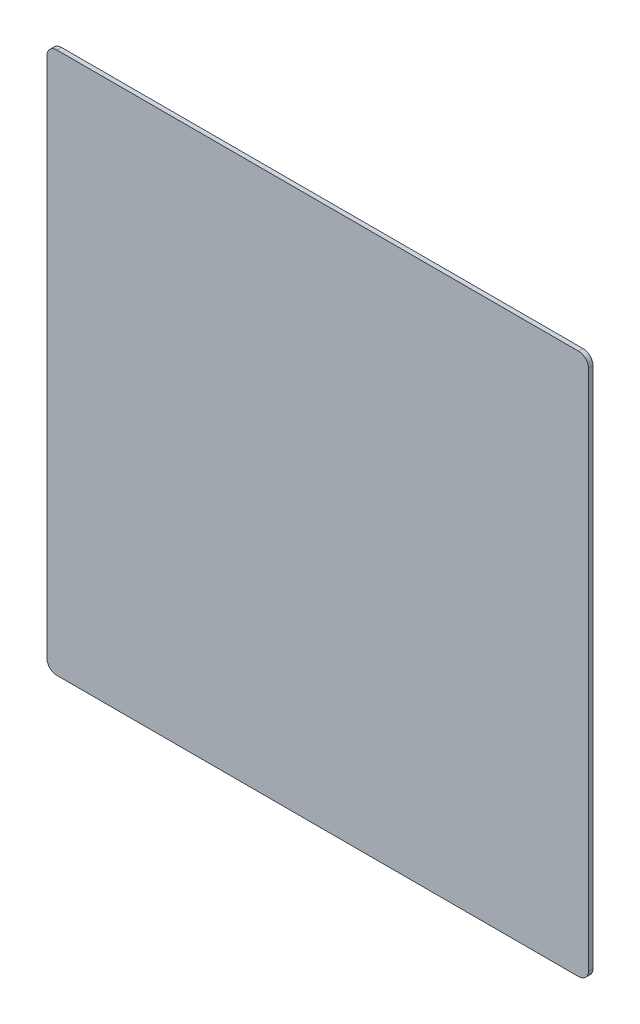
from build123d import *

# Parameters (mm, degrees)
EXTRUDE_1_DEPTH = 5


with BuildPart() as part:
    # Sketch 1 → Extrude 1 (new body)
    with BuildSketch(Plane.XY):
        with BuildLine():
            Line((-289, -300), (289, -300))
            ThreePointArc((289, -300), (296.778174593, -296.778174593), (300, -289))
            Line((300, -289), (300, 289))
            ThreePointArc((300, 289), (296.778174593, 296.778174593), (289, 300))
            Line((289, 300), (-289, 300))
            ThreePointArc((-289, 300), (-296.778174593, 296.778174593), (-300, 289))
            Line((-300, 289), (-300, -289))
            ThreePointArc((-300, -289), (-296.778174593, -296.778174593), (-289, -300))
        make_face()
    extrude(amount=EXTRUDE_1_DEPTH)


solid = part.part
